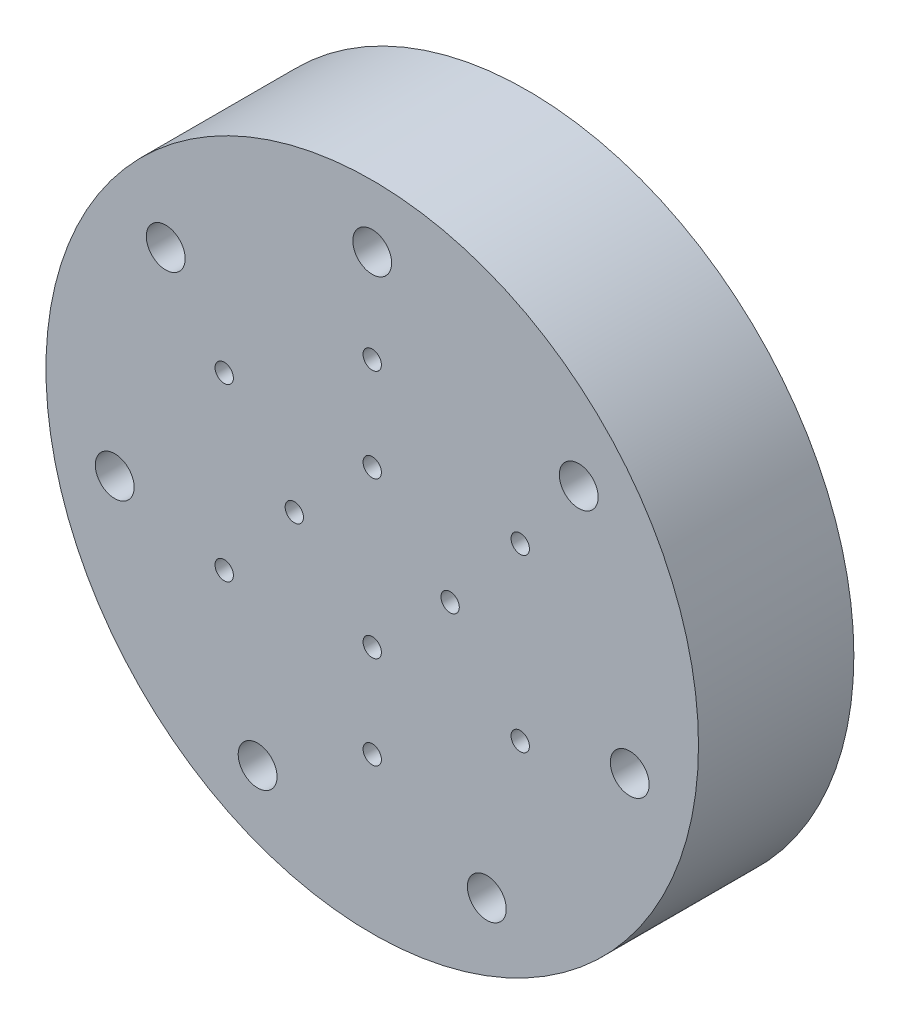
ISO-10303-21;
HEADER;
FILE_DESCRIPTION(('STEP AP214'),'2;1');
FILE_NAME('part.step','',(''),(''),'','','');
FILE_SCHEMA(('AUTOMOTIVE_DESIGN { 1 0 10303 214 1 1 1 1 }'));
ENDSEC;
DATA;
#1=APPLICATION_CONTEXT('core data for automotive mechanical design processes');
#2=APPLICATION_PROTOCOL_DEFINITION('international standard','automotive_design',2000,#1);
#3=PRODUCT_CONTEXT('',#1,'mechanical');
#4=PRODUCT('Part','Part','',(#3));
#5=PRODUCT_RELATED_PRODUCT_CATEGORY('part','',(#4));
#6=PRODUCT_DEFINITION_FORMATION('','',#4);
#7=PRODUCT_DEFINITION_CONTEXT('part definition',#1,'design');
#8=PRODUCT_DEFINITION('design','',#6,#7);
#9=PRODUCT_DEFINITION_SHAPE('','',#8);
#10=(LENGTH_UNIT() NAMED_UNIT(*) SI_UNIT(.MILLI.,.METRE.));
#11=(NAMED_UNIT(*) PLANE_ANGLE_UNIT() SI_UNIT($,.RADIAN.));
#12=(NAMED_UNIT(*) SI_UNIT($,.STERADIAN.) SOLID_ANGLE_UNIT());
#13=UNCERTAINTY_MEASURE_WITH_UNIT(LENGTH_MEASURE(1.E-05),#10,'distance_accuracy_value','');
#14=(GEOMETRIC_REPRESENTATION_CONTEXT(3) GLOBAL_UNCERTAINTY_ASSIGNED_CONTEXT((#13)) GLOBAL_UNIT_ASSIGNED_CONTEXT((#10,
#11,#12)) REPRESENTATION_CONTEXT('',''));
#15=CARTESIAN_POINT('',(0.,0.,0.));
#16=DIRECTION('',(0.,0.,1.));
#17=DIRECTION('',(1.,0.,0.));
#18=AXIS2_PLACEMENT_3D('',#15,#16,#17);
#19=CARTESIAN_POINT('',(0.,0.,12.7));
#20=DIRECTION('',(0.,0.,-1.));
#21=DIRECTION('',(-1.,0.,0.));
#22=AXIS2_PLACEMENT_3D('',#19,#20,#21);
#23=CYLINDRICAL_SURFACE('',#22,26.67);
#24=CARTESIAN_POINT('',(0.,0.,12.7));
#25=DIRECTION('',(0.,0.,1.));
#26=DIRECTION('',(1.,0.,0.));
#27=AXIS2_PLACEMENT_3D('',#24,#25,#26);
#28=CIRCLE('',#27,26.67);
#29=CARTESIAN_POINT('',(26.67,0.,12.7));
#30=VERTEX_POINT('',#29);
#31=EDGE_CURVE('E10',#30,#30,#28,.T.);
#32=ORIENTED_EDGE('',*,*,#31,.F.);
#33=EDGE_LOOP('',(#32));
#34=FACE_BOUND('',#33,.T.);
#35=CARTESIAN_POINT('',(0.,0.,0.));
#36=DIRECTION('',(0.,0.,1.));
#37=DIRECTION('',(1.,0.,0.));
#38=AXIS2_PLACEMENT_3D('',#35,#36,#37);
#39=CIRCLE('',#38,26.67);
#40=CARTESIAN_POINT('',(26.67,0.,0.));
#41=VERTEX_POINT('',#40);
#42=EDGE_CURVE('E45',#41,#41,#39,.T.);
#43=ORIENTED_EDGE('',*,*,#42,.T.);
#44=EDGE_LOOP('',(#43));
#45=FACE_BOUND('',#44,.T.);
#46=ADVANCED_FACE('F42',(#34,#45),#23,.T.);
#47=CARTESIAN_POINT('',(0.,0.,12.7));
#48=DIRECTION('',(0.,0.,1.));
#49=DIRECTION('',(1.,0.,0.));
#50=AXIS2_PLACEMENT_3D('',#47,#48,#49);
#51=PLANE('',#50);
#52=CARTESIAN_POINT('',(12.0983748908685,6.98500000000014,12.7));
#53=DIRECTION('',(0.,0.,1.));
#54=DIRECTION('',(0.50000000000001,-0.866025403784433,0.));
#55=AXIS2_PLACEMENT_3D('',#52,#53,#54);
#56=CIRCLE('',#55,0.75);
#57=CARTESIAN_POINT('',(12.4733748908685,6.33548094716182,12.7));
#58=VERTEX_POINT('',#57);
#59=EDGE_CURVE('E160',#58,#58,#56,.T.);
#60=ORIENTED_EDGE('',*,*,#59,.F.);
#61=EDGE_LOOP('',(#60));
#62=FACE_BOUND('',#61,.T.);
#63=CARTESIAN_POINT('',(12.0983748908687,-6.98499999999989,12.7));
#64=DIRECTION('',(0.,0.,1.));
#65=DIRECTION('',(-0.499999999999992,-0.866025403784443,0.));
#66=AXIS2_PLACEMENT_3D('',#63,#64,#65);
#67=CIRCLE('',#66,0.75);
#68=CARTESIAN_POINT('',(11.7233748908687,-7.63451905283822,12.7));
#69=VERTEX_POINT('',#68);
#70=EDGE_CURVE('E168',#69,#69,#67,.T.);
#71=ORIENTED_EDGE('',*,*,#70,.F.);
#72=EDGE_LOOP('',(#71));
#73=FACE_BOUND('',#72,.T.);
#74=CARTESIAN_POINT('',(0.,-13.97,12.7));
#75=DIRECTION('',(0.,0.,1.));
#76=DIRECTION('',(-1.,0.,0.));
#77=AXIS2_PLACEMENT_3D('',#74,#75,#76);
#78=CIRCLE('',#77,0.75);
#79=CARTESIAN_POINT('',(-0.75,-13.97,12.7));
#80=VERTEX_POINT('',#79);
#81=EDGE_CURVE('E176',#80,#80,#78,.T.);
#82=ORIENTED_EDGE('',*,*,#81,.F.);
#83=EDGE_LOOP('',(#82));
#84=FACE_BOUND('',#83,.T.);
#85=CARTESIAN_POINT('',(-12.0983748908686,-6.98500000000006,12.7));
#86=DIRECTION('',(0.,0.,1.));
#87=DIRECTION('',(-0.500000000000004,0.866025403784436,0.));
#88=AXIS2_PLACEMENT_3D('',#85,#86,#87);
#89=CIRCLE('',#88,0.75);
#90=CARTESIAN_POINT('',(-12.4733748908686,-6.33548094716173,12.7));
#91=VERTEX_POINT('',#90);
#92=EDGE_CURVE('E184',#91,#91,#89,.T.);
#93=ORIENTED_EDGE('',*,*,#92,.F.);
#94=EDGE_LOOP('',(#93));
#95=FACE_BOUND('',#94,.T.);
#96=CARTESIAN_POINT('',(-12.0983748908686,6.98499999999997,12.7));
#97=DIRECTION('',(0.,0.,1.));
#98=DIRECTION('',(0.499999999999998,0.86602540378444,0.));
#99=AXIS2_PLACEMENT_3D('',#96,#97,#98);
#100=CIRCLE('',#99,0.75);
#101=CARTESIAN_POINT('',(-11.7233748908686,7.6345190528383,12.7));
#102=VERTEX_POINT('',#101);
#103=EDGE_CURVE('E152',#102,#102,#100,.T.);
#104=ORIENTED_EDGE('',*,*,#103,.F.);
#105=EDGE_LOOP('',(#104));
#106=FACE_BOUND('',#105,.T.);
#107=CARTESIAN_POINT('',(-6.366504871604,-0.0165048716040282,12.7));
#108=DIRECTION('',(0.,0.,1.));
#109=DIRECTION('',(0.,1.,0.));
#110=AXIS2_PLACEMENT_3D('',#107,#108,#109);
#111=CIRCLE('',#110,0.75);
#112=CARTESIAN_POINT('',(-6.366504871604,0.733495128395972,12.7));
#113=VERTEX_POINT('',#112);
#114=EDGE_CURVE('E145',#113,#113,#111,.T.);
#115=ORIENTED_EDGE('',*,*,#114,.F.);
#116=EDGE_LOOP('',(#115));
#117=FACE_BOUND('',#116,.T.);
#118=CARTESIAN_POINT('',(0.,-6.38300974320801,12.7));
#119=DIRECTION('',(0.,0.,1.));
#120=DIRECTION('',(-1.,0.,0.));
#121=AXIS2_PLACEMENT_3D('',#118,#119,#120);
#122=CIRCLE('',#121,0.75);
#123=CARTESIAN_POINT('',(-0.749999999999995,-6.38300974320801,12.7));
#124=VERTEX_POINT('',#123);
#125=EDGE_CURVE('E137',#124,#124,#122,.T.);
#126=ORIENTED_EDGE('',*,*,#125,.F.);
#127=EDGE_LOOP('',(#126));
#128=FACE_BOUND('',#127,.T.);
#129=CARTESIAN_POINT('',(6.36650487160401,-0.016504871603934,12.7));
#130=DIRECTION('',(0.,0.,1.));
#131=DIRECTION('',(0.,-1.,0.));
#132=AXIS2_PLACEMENT_3D('',#129,#130,#131);
#133=CIRCLE('',#132,0.75);
#134=CARTESIAN_POINT('',(6.36650487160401,-0.766504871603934,12.7));
#135=VERTEX_POINT('',#134);
#136=EDGE_CURVE('E128',#135,#135,#133,.T.);
#137=ORIENTED_EDGE('',*,*,#136,.F.);
#138=EDGE_LOOP('',(#137));
#139=FACE_BOUND('',#138,.T.);
#140=CARTESIAN_POINT('',(0.,6.35,12.7));
#141=DIRECTION('',(0.,0.,1.));
#142=DIRECTION('',(1.,0.,0.));
#143=AXIS2_PLACEMENT_3D('',#140,#141,#142);
#144=CIRCLE('',#143,0.75);
#145=CARTESIAN_POINT('',(0.75,6.35,12.7));
#146=VERTEX_POINT('',#145);
#147=EDGE_CURVE('E120',#146,#146,#144,.T.);
#148=ORIENTED_EDGE('',*,*,#147,.F.);
#149=EDGE_LOOP('',(#148));
#150=FACE_BOUND('',#149,.T.);
#151=CARTESIAN_POINT('',(0.,13.97,12.7));
#152=DIRECTION('',(0.,0.,1.));
#153=DIRECTION('',(1.,0.,0.));
#154=AXIS2_PLACEMENT_3D('',#151,#152,#153);
#155=CIRCLE('',#154,0.75);
#156=CARTESIAN_POINT('',(0.75,13.97,12.7));
#157=VERTEX_POINT('',#156);
#158=EDGE_CURVE('E112',#157,#157,#155,.T.);
#159=ORIENTED_EDGE('',*,*,#158,.F.);
#160=EDGE_LOOP('',(#159));
#161=FACE_BOUND('',#160,.T.);
#162=CARTESIAN_POINT('',(16.8797417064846,13.4611448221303,12.7));
#163=DIRECTION('',(0.,0.,1.));
#164=DIRECTION('',(0.623489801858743,-0.781831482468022,0.));
#165=AXIS2_PLACEMENT_3D('',#162,#163,#164);
#166=CIRCLE('',#165,1.5875);
#167=CARTESIAN_POINT('',(17.8695317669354,12.2199873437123,12.7));
#168=VERTEX_POINT('',#167);
#169=EDGE_CURVE('E72',#168,#168,#166,.T.);
#170=ORIENTED_EDGE('',*,*,#169,.F.);
#171=EDGE_LOOP('',(#170));
#172=FACE_BOUND('',#171,.T.);
#173=CARTESIAN_POINT('',(21.0486936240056,-4.80422696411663,12.7));
#174=DIRECTION('',(0.,0.,1.));
#175=DIRECTION('',(-0.222520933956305,-0.974927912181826,0.));
#176=AXIS2_PLACEMENT_3D('',#173,#174,#175);
#177=CIRCLE('',#176,1.5875);
#178=CARTESIAN_POINT('',(20.69544164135,-6.35192502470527,12.7));
#179=VERTEX_POINT('',#178);
#180=EDGE_CURVE('E81',#179,#179,#177,.T.);
#181=ORIENTED_EDGE('',*,*,#180,.F.);
#182=EDGE_LOOP('',(#181));
#183=FACE_BOUND('',#182,.T.);
#184=CARTESIAN_POINT('',(9.36754992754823,-19.4519178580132,12.7));
#185=DIRECTION('',(0.,0.,1.));
#186=DIRECTION('',(-0.900968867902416,-0.433883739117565,0.));
#187=AXIS2_PLACEMENT_3D('',#184,#185,#186);
#188=CIRCLE('',#187,1.5875);
#189=CARTESIAN_POINT('',(7.93726184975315,-20.1407082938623,12.7));
#190=VERTEX_POINT('',#189);
#191=EDGE_CURVE('E89',#190,#190,#188,.T.);
#192=ORIENTED_EDGE('',*,*,#191,.F.);
#193=EDGE_LOOP('',(#192));
#194=FACE_BOUND('',#193,.T.);
#195=CARTESIAN_POINT('',(-9.36754992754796,-19.4519178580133,12.7));
#196=DIRECTION('',(0.,0.,1.));
#197=DIRECTION('',(-0.900968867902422,0.433883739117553,0.));
#198=AXIS2_PLACEMENT_3D('',#195,#196,#197);
#199=CIRCLE('',#198,1.5875);
#200=CARTESIAN_POINT('',(-10.7978380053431,-18.7631274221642,12.7));
#201=VERTEX_POINT('',#200);
#202=EDGE_CURVE('E97',#201,#201,#199,.T.);
#203=ORIENTED_EDGE('',*,*,#202,.F.);
#204=EDGE_LOOP('',(#203));
#205=FACE_BOUND('',#204,.T.);
#206=CARTESIAN_POINT('',(-21.0486936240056,-4.80422696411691,12.7));
#207=DIRECTION('',(0.,0.,1.));
#208=DIRECTION('',(-0.222520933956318,0.974927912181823,0.));
#209=AXIS2_PLACEMENT_3D('',#206,#207,#208);
#210=CIRCLE('',#209,1.5875);
#211=CARTESIAN_POINT('',(-21.4019456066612,-3.25652890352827,12.7));
#212=VERTEX_POINT('',#211);
#213=EDGE_CURVE('E105',#212,#212,#210,.T.);
#214=ORIENTED_EDGE('',*,*,#213,.F.);
#215=EDGE_LOOP('',(#214));
#216=FACE_BOUND('',#215,.T.);
#217=CARTESIAN_POINT('',(-16.8797417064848,13.46114482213,12.7));
#218=DIRECTION('',(0.,0.,1.));
#219=DIRECTION('',(0.623489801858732,0.781831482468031,0.));
#220=AXIS2_PLACEMENT_3D('',#217,#218,#219);
#221=CIRCLE('',#220,1.5875);
#222=CARTESIAN_POINT('',(-15.8899516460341,14.702302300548,12.7));
#223=VERTEX_POINT('',#222);
#224=EDGE_CURVE('E64',#223,#223,#221,.T.);
#225=ORIENTED_EDGE('',*,*,#224,.F.);
#226=EDGE_LOOP('',(#225));
#227=FACE_BOUND('',#226,.T.);
#228=CARTESIAN_POINT('',(0.,21.59,12.7));
#229=DIRECTION('',(0.,0.,1.));
#230=DIRECTION('',(1.,0.,0.));
#231=AXIS2_PLACEMENT_3D('',#228,#229,#230);
#232=CIRCLE('',#231,1.5875);
#233=CARTESIAN_POINT('',(1.5875,21.59,12.7));
#234=VERTEX_POINT('',#233);
#235=EDGE_CURVE('E56',#234,#234,#232,.T.);
#236=ORIENTED_EDGE('',*,*,#235,.F.);
#237=EDGE_LOOP('',(#236));
#238=FACE_BOUND('',#237,.T.);
#239=ORIENTED_EDGE('',*,*,#31,.T.);
#240=EDGE_LOOP('',(#239));
#241=FACE_BOUND('',#240,.T.);
#242=ADVANCED_FACE('F203',(#62,#73,#84,#95,#106,#117,#128,#139,#150,#161,#172,#183,#194,#205,
#216,#227,#238,#241),#51,.T.);
#243=CARTESIAN_POINT('',(0.,0.,0.));
#244=DIRECTION('',(0.,0.,1.));
#245=DIRECTION('',(1.,0.,0.));
#246=AXIS2_PLACEMENT_3D('',#243,#244,#245);
#247=PLANE('',#246);
#248=CARTESIAN_POINT('',(12.0983748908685,6.98500000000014,0.));
#249=DIRECTION('',(0.,0.,1.));
#250=DIRECTION('',(0.50000000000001,-0.866025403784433,0.));
#251=AXIS2_PLACEMENT_3D('',#248,#249,#250);
#252=CIRCLE('',#251,0.75);
#253=CARTESIAN_POINT('',(12.4733748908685,6.33548094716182,0.));
#254=VERTEX_POINT('',#253);
#255=EDGE_CURVE('E164',#254,#254,#252,.T.);
#256=ORIENTED_EDGE('',*,*,#255,.T.);
#257=EDGE_LOOP('',(#256));
#258=FACE_BOUND('',#257,.T.);
#259=CARTESIAN_POINT('',(12.0983748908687,-6.98499999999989,0.));
#260=DIRECTION('',(0.,0.,1.));
#261=DIRECTION('',(-0.499999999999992,-0.866025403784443,0.));
#262=AXIS2_PLACEMENT_3D('',#259,#260,#261);
#263=CIRCLE('',#262,0.75);
#264=CARTESIAN_POINT('',(11.7233748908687,-7.63451905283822,0.));
#265=VERTEX_POINT('',#264);
#266=EDGE_CURVE('E172',#265,#265,#263,.T.);
#267=ORIENTED_EDGE('',*,*,#266,.T.);
#268=EDGE_LOOP('',(#267));
#269=FACE_BOUND('',#268,.T.);
#270=CARTESIAN_POINT('',(0.,-13.97,0.));
#271=DIRECTION('',(0.,0.,1.));
#272=DIRECTION('',(-1.,0.,0.));
#273=AXIS2_PLACEMENT_3D('',#270,#271,#272);
#274=CIRCLE('',#273,0.75);
#275=CARTESIAN_POINT('',(-0.75,-13.97,0.));
#276=VERTEX_POINT('',#275);
#277=EDGE_CURVE('E180',#276,#276,#274,.T.);
#278=ORIENTED_EDGE('',*,*,#277,.T.);
#279=EDGE_LOOP('',(#278));
#280=FACE_BOUND('',#279,.T.);
#281=CARTESIAN_POINT('',(-12.0983748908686,-6.98500000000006,0.));
#282=DIRECTION('',(0.,0.,1.));
#283=DIRECTION('',(-0.500000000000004,0.866025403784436,0.));
#284=AXIS2_PLACEMENT_3D('',#281,#282,#283);
#285=CIRCLE('',#284,0.75);
#286=CARTESIAN_POINT('',(-12.4733748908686,-6.33548094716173,0.));
#287=VERTEX_POINT('',#286);
#288=EDGE_CURVE('E156',#287,#287,#285,.T.);
#289=ORIENTED_EDGE('',*,*,#288,.T.);
#290=EDGE_LOOP('',(#289));
#291=FACE_BOUND('',#290,.T.);
#292=CARTESIAN_POINT('',(-12.0983748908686,6.98499999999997,0.));
#293=DIRECTION('',(0.,0.,1.));
#294=DIRECTION('',(0.499999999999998,0.86602540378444,0.));
#295=AXIS2_PLACEMENT_3D('',#292,#293,#294);
#296=CIRCLE('',#295,0.75);
#297=CARTESIAN_POINT('',(-11.7233748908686,7.6345190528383,0.));
#298=VERTEX_POINT('',#297);
#299=EDGE_CURVE('E133',#298,#298,#296,.T.);
#300=ORIENTED_EDGE('',*,*,#299,.T.);
#301=EDGE_LOOP('',(#300));
#302=FACE_BOUND('',#301,.T.);
#303=CARTESIAN_POINT('',(-6.366504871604,-0.0165048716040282,0.));
#304=DIRECTION('',(0.,0.,1.));
#305=DIRECTION('',(0.,1.,0.));
#306=AXIS2_PLACEMENT_3D('',#303,#304,#305);
#307=CIRCLE('',#306,0.75);
#308=CARTESIAN_POINT('',(-6.366504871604,0.733495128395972,0.));
#309=VERTEX_POINT('',#308);
#310=EDGE_CURVE('E124',#309,#309,#307,.T.);
#311=ORIENTED_EDGE('',*,*,#310,.T.);
#312=EDGE_LOOP('',(#311));
#313=FACE_BOUND('',#312,.T.);
#314=CARTESIAN_POINT('',(0.,-6.38300974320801,0.));
#315=DIRECTION('',(0.,0.,1.));
#316=DIRECTION('',(-1.,0.,0.));
#317=AXIS2_PLACEMENT_3D('',#314,#315,#316);
#318=CIRCLE('',#317,0.75);
#319=CARTESIAN_POINT('',(-0.749999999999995,-6.38300974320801,0.));
#320=VERTEX_POINT('',#319);
#321=EDGE_CURVE('E141',#320,#320,#318,.T.);
#322=ORIENTED_EDGE('',*,*,#321,.T.);
#323=EDGE_LOOP('',(#322));
#324=FACE_BOUND('',#323,.T.);
#325=CARTESIAN_POINT('',(6.36650487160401,-0.016504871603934,0.));
#326=DIRECTION('',(0.,0.,1.));
#327=DIRECTION('',(0.,-1.,0.));
#328=AXIS2_PLACEMENT_3D('',#325,#326,#327);
#329=CIRCLE('',#328,0.75);
#330=CARTESIAN_POINT('',(6.36650487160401,-0.766504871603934,0.));
#331=VERTEX_POINT('',#330);
#332=EDGE_CURVE('E132',#331,#331,#329,.T.);
#333=ORIENTED_EDGE('',*,*,#332,.T.);
#334=EDGE_LOOP('',(#333));
#335=FACE_BOUND('',#334,.T.);
#336=CARTESIAN_POINT('',(0.,6.35,0.));
#337=DIRECTION('',(0.,0.,1.));
#338=DIRECTION('',(1.,0.,0.));
#339=AXIS2_PLACEMENT_3D('',#336,#337,#338);
#340=CIRCLE('',#339,0.75);
#341=CARTESIAN_POINT('',(0.75,6.35,0.));
#342=VERTEX_POINT('',#341);
#343=EDGE_CURVE('E116',#342,#342,#340,.T.);
#344=ORIENTED_EDGE('',*,*,#343,.T.);
#345=EDGE_LOOP('',(#344));
#346=FACE_BOUND('',#345,.T.);
#347=CARTESIAN_POINT('',(0.,13.97,0.));
#348=DIRECTION('',(0.,0.,1.));
#349=DIRECTION('',(1.,0.,0.));
#350=AXIS2_PLACEMENT_3D('',#347,#348,#349);
#351=CIRCLE('',#350,0.75);
#352=CARTESIAN_POINT('',(0.75,13.97,0.));
#353=VERTEX_POINT('',#352);
#354=EDGE_CURVE('E77',#353,#353,#351,.T.);
#355=ORIENTED_EDGE('',*,*,#354,.T.);
#356=EDGE_LOOP('',(#355));
#357=FACE_BOUND('',#356,.T.);
#358=CARTESIAN_POINT('',(16.8797417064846,13.4611448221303,0.));
#359=DIRECTION('',(0.,0.,1.));
#360=DIRECTION('',(0.623489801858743,-0.781831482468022,0.));
#361=AXIS2_PLACEMENT_3D('',#358,#359,#360);
#362=CIRCLE('',#361,1.5875);
#363=CARTESIAN_POINT('',(17.8695317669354,12.2199873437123,0.));
#364=VERTEX_POINT('',#363);
#365=EDGE_CURVE('E76',#364,#364,#362,.T.);
#366=ORIENTED_EDGE('',*,*,#365,.T.);
#367=EDGE_LOOP('',(#366));
#368=FACE_BOUND('',#367,.T.);
#369=CARTESIAN_POINT('',(21.0486936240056,-4.80422696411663,0.));
#370=DIRECTION('',(0.,0.,1.));
#371=DIRECTION('',(-0.222520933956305,-0.974927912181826,0.));
#372=AXIS2_PLACEMENT_3D('',#369,#370,#371);
#373=CIRCLE('',#372,1.5875);
#374=CARTESIAN_POINT('',(20.69544164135,-6.35192502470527,0.));
#375=VERTEX_POINT('',#374);
#376=EDGE_CURVE('E85',#375,#375,#373,.T.);
#377=ORIENTED_EDGE('',*,*,#376,.T.);
#378=EDGE_LOOP('',(#377));
#379=FACE_BOUND('',#378,.T.);
#380=CARTESIAN_POINT('',(9.36754992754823,-19.4519178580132,0.));
#381=DIRECTION('',(0.,0.,1.));
#382=DIRECTION('',(-0.900968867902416,-0.433883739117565,0.));
#383=AXIS2_PLACEMENT_3D('',#380,#381,#382);
#384=CIRCLE('',#383,1.5875);
#385=CARTESIAN_POINT('',(7.93726184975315,-20.1407082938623,0.));
#386=VERTEX_POINT('',#385);
#387=EDGE_CURVE('E93',#386,#386,#384,.T.);
#388=ORIENTED_EDGE('',*,*,#387,.T.);
#389=EDGE_LOOP('',(#388));
#390=FACE_BOUND('',#389,.T.);
#391=CARTESIAN_POINT('',(-9.36754992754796,-19.4519178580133,0.));
#392=DIRECTION('',(0.,0.,1.));
#393=DIRECTION('',(-0.900968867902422,0.433883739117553,0.));
#394=AXIS2_PLACEMENT_3D('',#391,#392,#393);
#395=CIRCLE('',#394,1.5875);
#396=CARTESIAN_POINT('',(-10.7978380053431,-18.7631274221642,0.));
#397=VERTEX_POINT('',#396);
#398=EDGE_CURVE('E101',#397,#397,#395,.T.);
#399=ORIENTED_EDGE('',*,*,#398,.T.);
#400=EDGE_LOOP('',(#399));
#401=FACE_BOUND('',#400,.T.);
#402=CARTESIAN_POINT('',(-21.0486936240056,-4.80422696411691,0.));
#403=DIRECTION('',(0.,0.,1.));
#404=DIRECTION('',(-0.222520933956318,0.974927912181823,0.));
#405=AXIS2_PLACEMENT_3D('',#402,#403,#404);
#406=CIRCLE('',#405,1.5875);
#407=CARTESIAN_POINT('',(-21.4019456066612,-3.25652890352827,0.));
#408=VERTEX_POINT('',#407);
#409=EDGE_CURVE('E68',#408,#408,#406,.T.);
#410=ORIENTED_EDGE('',*,*,#409,.T.);
#411=EDGE_LOOP('',(#410));
#412=FACE_BOUND('',#411,.T.);
#413=CARTESIAN_POINT('',(-16.8797417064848,13.46114482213,0.));
#414=DIRECTION('',(0.,0.,1.));
#415=DIRECTION('',(0.623489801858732,0.781831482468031,0.));
#416=AXIS2_PLACEMENT_3D('',#413,#414,#415);
#417=CIRCLE('',#416,1.5875);
#418=CARTESIAN_POINT('',(-15.8899516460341,14.702302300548,0.));
#419=VERTEX_POINT('',#418);
#420=EDGE_CURVE('E60',#419,#419,#417,.T.);
#421=ORIENTED_EDGE('',*,*,#420,.T.);
#422=EDGE_LOOP('',(#421));
#423=FACE_BOUND('',#422,.T.);
#424=CARTESIAN_POINT('',(0.,21.59,0.));
#425=DIRECTION('',(0.,0.,1.));
#426=DIRECTION('',(1.,0.,0.));
#427=AXIS2_PLACEMENT_3D('',#424,#425,#426);
#428=CIRCLE('',#427,1.5875);
#429=CARTESIAN_POINT('',(1.5875,21.59,0.));
#430=VERTEX_POINT('',#429);
#431=EDGE_CURVE('E54',#430,#430,#428,.T.);
#432=ORIENTED_EDGE('',*,*,#431,.T.);
#433=EDGE_LOOP('',(#432));
#434=FACE_BOUND('',#433,.T.);
#435=ORIENTED_EDGE('',*,*,#42,.F.);
#436=EDGE_LOOP('',(#435));
#437=FACE_BOUND('',#436,.T.);
#438=ADVANCED_FACE('F192',(#258,#269,#280,#291,#302,#313,#324,#335,#346,#357,#368,#379,#390,
#401,#412,#423,#434,#437),#247,.F.);
#439=CARTESIAN_POINT('',(0.,21.59,0.));
#440=DIRECTION('',(0.,0.,1.));
#441=DIRECTION('',(1.,0.,0.));
#442=AXIS2_PLACEMENT_3D('',#439,#440,#441);
#443=CYLINDRICAL_SURFACE('',#442,1.5875);
#444=ORIENTED_EDGE('',*,*,#431,.F.);
#445=EDGE_LOOP('',(#444));
#446=FACE_BOUND('',#445,.T.);
#447=ORIENTED_EDGE('',*,*,#235,.T.);
#448=EDGE_LOOP('',(#447));
#449=FACE_BOUND('',#448,.T.);
#450=ADVANCED_FACE('F234',(#446,#449),#443,.F.);
#451=CARTESIAN_POINT('',(-16.8797417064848,13.46114482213,0.));
#452=DIRECTION('',(0.,0.,1.));
#453=DIRECTION('',(1.,0.,0.));
#454=AXIS2_PLACEMENT_3D('',#451,#452,#453);
#455=CYLINDRICAL_SURFACE('',#454,1.5875);
#456=ORIENTED_EDGE('',*,*,#420,.F.);
#457=EDGE_LOOP('',(#456));
#458=FACE_BOUND('',#457,.T.);
#459=ORIENTED_EDGE('',*,*,#224,.T.);
#460=EDGE_LOOP('',(#459));
#461=FACE_BOUND('',#460,.T.);
#462=ADVANCED_FACE('F236',(#458,#461),#455,.F.);
#463=CARTESIAN_POINT('',(-21.0486936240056,-4.80422696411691,0.));
#464=DIRECTION('',(0.,0.,1.));
#465=DIRECTION('',(1.,0.,0.));
#466=AXIS2_PLACEMENT_3D('',#463,#464,#465);
#467=CYLINDRICAL_SURFACE('',#466,1.5875);
#468=ORIENTED_EDGE('',*,*,#409,.F.);
#469=EDGE_LOOP('',(#468));
#470=FACE_BOUND('',#469,.T.);
#471=ORIENTED_EDGE('',*,*,#213,.T.);
#472=EDGE_LOOP('',(#471));
#473=FACE_BOUND('',#472,.T.);
#474=ADVANCED_FACE('F243',(#470,#473),#467,.F.);
#475=CARTESIAN_POINT('',(-9.36754992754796,-19.4519178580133,0.));
#476=DIRECTION('',(0.,0.,1.));
#477=DIRECTION('',(1.,0.,0.));
#478=AXIS2_PLACEMENT_3D('',#475,#476,#477);
#479=CYLINDRICAL_SURFACE('',#478,1.5875);
#480=ORIENTED_EDGE('',*,*,#398,.F.);
#481=EDGE_LOOP('',(#480));
#482=FACE_BOUND('',#481,.T.);
#483=ORIENTED_EDGE('',*,*,#202,.T.);
#484=EDGE_LOOP('',(#483));
#485=FACE_BOUND('',#484,.T.);
#486=ADVANCED_FACE('F289',(#482,#485),#479,.F.);
#487=CARTESIAN_POINT('',(9.36754992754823,-19.4519178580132,0.));
#488=DIRECTION('',(0.,0.,1.));
#489=DIRECTION('',(1.,0.,0.));
#490=AXIS2_PLACEMENT_3D('',#487,#488,#489);
#491=CYLINDRICAL_SURFACE('',#490,1.5875);
#492=ORIENTED_EDGE('',*,*,#387,.F.);
#493=EDGE_LOOP('',(#492));
#494=FACE_BOUND('',#493,.T.);
#495=ORIENTED_EDGE('',*,*,#191,.T.);
#496=EDGE_LOOP('',(#495));
#497=FACE_BOUND('',#496,.T.);
#498=ADVANCED_FACE('F299',(#494,#497),#491,.F.);
#499=CARTESIAN_POINT('',(21.0486936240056,-4.80422696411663,0.));
#500=DIRECTION('',(0.,0.,1.));
#501=DIRECTION('',(1.,0.,0.));
#502=AXIS2_PLACEMENT_3D('',#499,#500,#501);
#503=CYLINDRICAL_SURFACE('',#502,1.5875);
#504=ORIENTED_EDGE('',*,*,#376,.F.);
#505=EDGE_LOOP('',(#504));
#506=FACE_BOUND('',#505,.T.);
#507=ORIENTED_EDGE('',*,*,#180,.T.);
#508=EDGE_LOOP('',(#507));
#509=FACE_BOUND('',#508,.T.);
#510=ADVANCED_FACE('F309',(#506,#509),#503,.F.);
#511=CARTESIAN_POINT('',(16.8797417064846,13.4611448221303,0.));
#512=DIRECTION('',(0.,0.,1.));
#513=DIRECTION('',(1.,0.,0.));
#514=AXIS2_PLACEMENT_3D('',#511,#512,#513);
#515=CYLINDRICAL_SURFACE('',#514,1.5875);
#516=ORIENTED_EDGE('',*,*,#365,.F.);
#517=EDGE_LOOP('',(#516));
#518=FACE_BOUND('',#517,.T.);
#519=ORIENTED_EDGE('',*,*,#169,.T.);
#520=EDGE_LOOP('',(#519));
#521=FACE_BOUND('',#520,.T.);
#522=ADVANCED_FACE('F319',(#518,#521),#515,.F.);
#523=CARTESIAN_POINT('',(0.,13.97,0.));
#524=DIRECTION('',(0.,0.,1.));
#525=DIRECTION('',(1.,0.,0.));
#526=AXIS2_PLACEMENT_3D('',#523,#524,#525);
#527=CYLINDRICAL_SURFACE('',#526,0.75);
#528=ORIENTED_EDGE('',*,*,#354,.F.);
#529=EDGE_LOOP('',(#528));
#530=FACE_BOUND('',#529,.T.);
#531=ORIENTED_EDGE('',*,*,#158,.T.);
#532=EDGE_LOOP('',(#531));
#533=FACE_BOUND('',#532,.T.);
#534=ADVANCED_FACE('F329',(#530,#533),#527,.F.);
#535=CARTESIAN_POINT('',(0.,6.35,0.));
#536=DIRECTION('',(0.,0.,1.));
#537=DIRECTION('',(1.,0.,0.));
#538=AXIS2_PLACEMENT_3D('',#535,#536,#537);
#539=CYLINDRICAL_SURFACE('',#538,0.75);
#540=ORIENTED_EDGE('',*,*,#343,.F.);
#541=EDGE_LOOP('',(#540));
#542=FACE_BOUND('',#541,.T.);
#543=ORIENTED_EDGE('',*,*,#147,.T.);
#544=EDGE_LOOP('',(#543));
#545=FACE_BOUND('',#544,.T.);
#546=ADVANCED_FACE('F339',(#542,#545),#539,.F.);
#547=CARTESIAN_POINT('',(6.36650487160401,-0.016504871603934,0.));
#548=DIRECTION('',(0.,0.,1.));
#549=DIRECTION('',(1.,0.,0.));
#550=AXIS2_PLACEMENT_3D('',#547,#548,#549);
#551=CYLINDRICAL_SURFACE('',#550,0.75);
#552=ORIENTED_EDGE('',*,*,#332,.F.);
#553=EDGE_LOOP('',(#552));
#554=FACE_BOUND('',#553,.T.);
#555=ORIENTED_EDGE('',*,*,#136,.T.);
#556=EDGE_LOOP('',(#555));
#557=FACE_BOUND('',#556,.T.);
#558=ADVANCED_FACE('F349',(#554,#557),#551,.F.);
#559=CARTESIAN_POINT('',(0.,-6.38300974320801,0.));
#560=DIRECTION('',(0.,0.,1.));
#561=DIRECTION('',(1.,0.,0.));
#562=AXIS2_PLACEMENT_3D('',#559,#560,#561);
#563=CYLINDRICAL_SURFACE('',#562,0.75);
#564=ORIENTED_EDGE('',*,*,#321,.F.);
#565=EDGE_LOOP('',(#564));
#566=FACE_BOUND('',#565,.T.);
#567=ORIENTED_EDGE('',*,*,#125,.T.);
#568=EDGE_LOOP('',(#567));
#569=FACE_BOUND('',#568,.T.);
#570=ADVANCED_FACE('F359',(#566,#569),#563,.F.);
#571=CARTESIAN_POINT('',(-6.366504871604,-0.0165048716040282,0.));
#572=DIRECTION('',(0.,0.,1.));
#573=DIRECTION('',(1.,0.,0.));
#574=AXIS2_PLACEMENT_3D('',#571,#572,#573);
#575=CYLINDRICAL_SURFACE('',#574,0.75);
#576=ORIENTED_EDGE('',*,*,#310,.F.);
#577=EDGE_LOOP('',(#576));
#578=FACE_BOUND('',#577,.T.);
#579=ORIENTED_EDGE('',*,*,#114,.T.);
#580=EDGE_LOOP('',(#579));
#581=FACE_BOUND('',#580,.T.);
#582=ADVANCED_FACE('F369',(#578,#581),#575,.F.);
#583=CARTESIAN_POINT('',(-12.0983748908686,6.98499999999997,0.));
#584=DIRECTION('',(0.,0.,1.));
#585=DIRECTION('',(1.,0.,0.));
#586=AXIS2_PLACEMENT_3D('',#583,#584,#585);
#587=CYLINDRICAL_SURFACE('',#586,0.75);
#588=ORIENTED_EDGE('',*,*,#299,.F.);
#589=EDGE_LOOP('',(#588));
#590=FACE_BOUND('',#589,.T.);
#591=ORIENTED_EDGE('',*,*,#103,.T.);
#592=EDGE_LOOP('',(#591));
#593=FACE_BOUND('',#592,.T.);
#594=ADVANCED_FACE('F199',(#590,#593),#587,.F.);
#595=CARTESIAN_POINT('',(-12.0983748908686,-6.98500000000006,0.));
#596=DIRECTION('',(0.,0.,1.));
#597=DIRECTION('',(1.,0.,0.));
#598=AXIS2_PLACEMENT_3D('',#595,#596,#597);
#599=CYLINDRICAL_SURFACE('',#598,0.75);
#600=ORIENTED_EDGE('',*,*,#288,.F.);
#601=EDGE_LOOP('',(#600));
#602=FACE_BOUND('',#601,.T.);
#603=ORIENTED_EDGE('',*,*,#92,.T.);
#604=EDGE_LOOP('',(#603));
#605=FACE_BOUND('',#604,.T.);
#606=ADVANCED_FACE('F195',(#602,#605),#599,.F.);
#607=CARTESIAN_POINT('',(0.,-13.97,0.));
#608=DIRECTION('',(0.,0.,1.));
#609=DIRECTION('',(1.,0.,0.));
#610=AXIS2_PLACEMENT_3D('',#607,#608,#609);
#611=CYLINDRICAL_SURFACE('',#610,0.75);
#612=ORIENTED_EDGE('',*,*,#277,.F.);
#613=EDGE_LOOP('',(#612));
#614=FACE_BOUND('',#613,.T.);
#615=ORIENTED_EDGE('',*,*,#81,.T.);
#616=EDGE_LOOP('',(#615));
#617=FACE_BOUND('',#616,.T.);
#618=ADVANCED_FACE('F198',(#614,#617),#611,.F.);
#619=CARTESIAN_POINT('',(12.0983748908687,-6.98499999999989,0.));
#620=DIRECTION('',(0.,0.,1.));
#621=DIRECTION('',(1.,0.,0.));
#622=AXIS2_PLACEMENT_3D('',#619,#620,#621);
#623=CYLINDRICAL_SURFACE('',#622,0.75);
#624=ORIENTED_EDGE('',*,*,#266,.F.);
#625=EDGE_LOOP('',(#624));
#626=FACE_BOUND('',#625,.T.);
#627=ORIENTED_EDGE('',*,*,#70,.T.);
#628=EDGE_LOOP('',(#627));
#629=FACE_BOUND('',#628,.T.);
#630=ADVANCED_FACE('F401',(#626,#629),#623,.F.);
#631=CARTESIAN_POINT('',(12.0983748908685,6.98500000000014,0.));
#632=DIRECTION('',(0.,0.,1.));
#633=DIRECTION('',(1.,0.,0.));
#634=AXIS2_PLACEMENT_3D('',#631,#632,#633);
#635=CYLINDRICAL_SURFACE('',#634,0.75);
#636=ORIENTED_EDGE('',*,*,#255,.F.);
#637=EDGE_LOOP('',(#636));
#638=FACE_BOUND('',#637,.T.);
#639=ORIENTED_EDGE('',*,*,#59,.T.);
#640=EDGE_LOOP('',(#639));
#641=FACE_BOUND('',#640,.T.);
#642=ADVANCED_FACE('F411',(#638,#641),#635,.F.);
#643=CLOSED_SHELL('',(#46,#242,#438,#450,#462,#474,#486,#498,#510,#522,#534,#546,#558,#570,#582,
#594,#606,#618,#630,#642));
#644=MANIFOLD_SOLID_BREP('B2',#643);
#645=ADVANCED_BREP_SHAPE_REPRESENTATION('',(#18,#644),#14);
#646=SHAPE_DEFINITION_REPRESENTATION(#9,#645);
ENDSEC;
END-ISO-10303-21;
